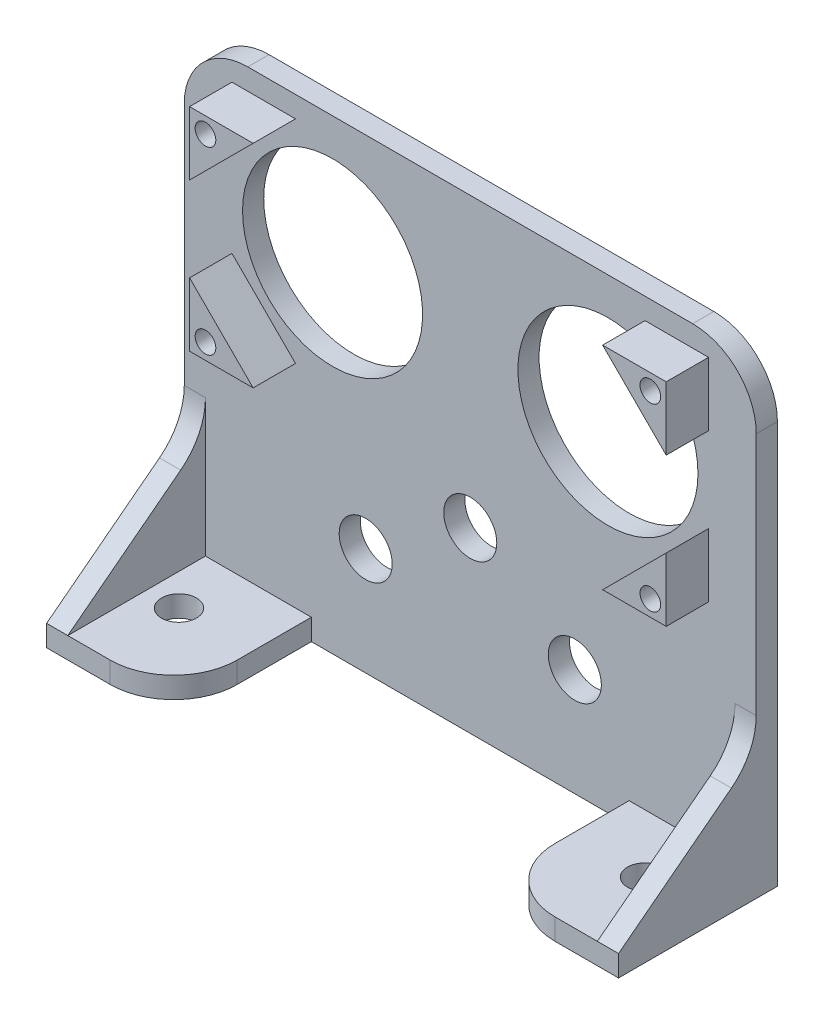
from build123d import *

# Parameters (mm, degrees)
SKETCH1_W               = 54
SKETCH1_H               = 44
SKETCH1_R               = 8.5
SKETCH1_R_2             = 2.505
BOSS_EXTRUDE1_DEPTH     = 2
SKETCH8_W               = 54
SKETCH8_H               = 15
SKETCH8_R               = 1.65
BOSS_EXTRUDE5_DEPTH     = 2
BOSS_EXTRUDE7_DEPTH     = 2
FILLET9_R               = 6
BOSS_EXTRUDE8_DEPTH     = 4
SKETCH15_R              = 2.5
CUT_EXTRUDE1_DEPTH      = 2
CUT_EXTRUDE2_DEPTH      = 53.402290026
CUT_EXTRUDE2_DEPTH_BACK = 53.402290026
SKETCH16_R              = 0.975
SKETCH17_W              = 30
SKETCH17_H              = 13
CUT_EXTRUDE4_DEPTH      = 10
FILLET10_R              = 6


with BuildPart() as part:
    # Sketch1 → Boss-Extrude1 (new body)
    with BuildSketch(Plane.XY):
        with Locations((0, 22)):
            Rectangle(SKETCH1_W, SKETCH1_H)
        with Locations((13, 32)):
            Circle(SKETCH1_R, mode=Mode.SUBTRACT)
        with Locations(Location((-13, 32, 0), (0, 0, 180))):
            Circle(SKETCH1_R, mode=Mode.SUBTRACT)
        with Locations((0, 16.813141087)):
            Circle(SKETCH1_R_2, mode=Mode.SUBTRACT)
        with Locations((9.873380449, 10.148043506)):
            Circle(SKETCH1_R_2, mode=Mode.SUBTRACT)
        with Locations(Location((-9.873380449, 10.148043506, 0), (0, 0, 180))):
            Circle(SKETCH1_R_2, mode=Mode.SUBTRACT)
    extrude(amount=BOSS_EXTRUDE1_DEPTH)

    # Sketch8 → Boss-Extrude5 (add)
    with BuildSketch(Plane.XZ):
        with Locations((0, 7.5)):
            Rectangle(SKETCH8_W, SKETCH8_H)
        with Locations(Location((22, 7.5, 0), (0, 0, 270))):
            Circle(SKETCH8_R, mode=Mode.SUBTRACT)
        with Locations(Location((-22, 7.5, 0), (0, 0, 90))):
            Circle(SKETCH8_R, mode=Mode.SUBTRACT)
    extrude(amount=-BOSS_EXTRUDE5_DEPTH)

    # Sketch12 → Boss-Extrude7 (add)
    with BuildSketch(Plane.ZY.offset(27)):
        Polygon((15, 2), (2, 12), (0, 12), (0, 0), (15, 0), align=None)
    boss_extrude7 = extrude(amount=-BOSS_EXTRUDE7_DEPTH)

    # Mirror1: Boss-Extrude7 across plane
    add(boss_extrude7.mirror(Plane(origin=(0, 0, 0), x_dir=(0, 0, 1), z_dir=(1, 0, 0))))

    # Fillet9
    fillet9_edges = [part.edges().sort_by_distance(p)[0] for p in [
        (-26, 12, 2),
        (-27, 44, 1),
        (27, 44, 1),
        (26, 12, 2),
    ]]
    fillet(fillet9_edges, radius=FILLET9_R)

    # Sketch13 → Boss-Extrude8 (add)
    with BuildSketch(Plane.XY.offset(2)):
        Polygon((-22.5, 42), (-16.5, 42), (-22.5, 36), align=None)
        Polygon((-22.5, 22), (-16.5, 22), (-22.5, 28), align=None)
        Polygon((22.5, 42), (22.5, 36), (16.5, 42), align=None)
        Polygon((22.5, 28), (16.5, 22), (22.5, 22), align=None)
    extrude(amount=BOSS_EXTRUDE8_DEPTH)

    # Sketch15 → Cut-Extrude1 (cut, symmetric)
    with BuildSketch(Plane.XZ):
        with Locations(Location((7, 6, 0), (0, 0, 270))):
            Circle(SKETCH15_R)
        with Locations(Location((-7, 6, 0), (0, 0, 90))):
            Circle(SKETCH15_R)
    extrude(amount=CUT_EXTRUDE1_DEPTH, both=True, mode=Mode.SUBTRACT)

    # Sketch16 → Cut-Extrude2 (cut, two sides: drawn at the far end of the back side and taken through both)
    with BuildSketch(Plane.XY.offset(6).offset(-CUT_EXTRUDE2_DEPTH_BACK)):
        with Locations((21, 23.5)):
            Circle(SKETCH16_R)
        with Locations((21, 40.5)):
            Circle(SKETCH16_R)
        with Locations((-21, 40.5)):
            Circle(SKETCH16_R)
        with Locations((-21, 23.5)):
            Circle(SKETCH16_R)
    extrude(amount=CUT_EXTRUDE2_DEPTH + CUT_EXTRUDE2_DEPTH_BACK, mode=Mode.SUBTRACT)

    # Sketch17 → Cut-Extrude4 (cut)
    with BuildSketch(Plane(origin=(0, 2, 0), x_dir=(1, 0, 0), z_dir=(0, 1, 0))):
        with Locations((0, -8.5)):
            Rectangle(SKETCH17_W, SKETCH17_H)
    extrude(amount=-CUT_EXTRUDE4_DEPTH, mode=Mode.SUBTRACT)

    # Fillet10
    fillet10_edges = [part.edges().sort_by_distance(p)[0] for p in [
        (-15, 1, 15),
        (15, 1, 15),
    ]]
    fillet(fillet10_edges, radius=FILLET10_R)


solid = part.part
